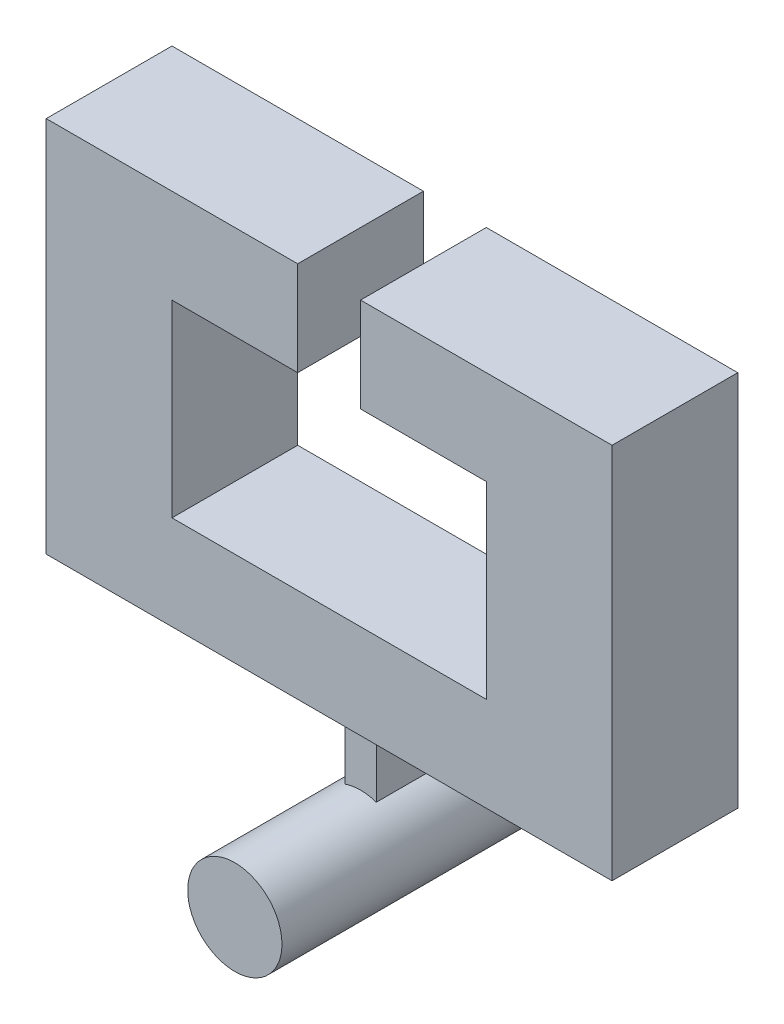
ISO-10303-21;
HEADER;
FILE_DESCRIPTION(('STEP AP214'),'2;1');
FILE_NAME('part.step','',(''),(''),'','','');
FILE_SCHEMA(('AUTOMOTIVE_DESIGN { 1 0 10303 214 1 1 1 1 }'));
ENDSEC;
DATA;
#1=APPLICATION_CONTEXT('core data for automotive mechanical design processes');
#2=APPLICATION_PROTOCOL_DEFINITION('international standard','automotive_design',2000,#1);
#3=PRODUCT_CONTEXT('',#1,'mechanical');
#4=PRODUCT('Part','Part','',(#3));
#5=PRODUCT_RELATED_PRODUCT_CATEGORY('part','',(#4));
#6=PRODUCT_DEFINITION_FORMATION('','',#4);
#7=PRODUCT_DEFINITION_CONTEXT('part definition',#1,'design');
#8=PRODUCT_DEFINITION('design','',#6,#7);
#9=PRODUCT_DEFINITION_SHAPE('','',#8);
#10=(LENGTH_UNIT() NAMED_UNIT(*) SI_UNIT(.MILLI.,.METRE.));
#11=(NAMED_UNIT(*) PLANE_ANGLE_UNIT() SI_UNIT($,.RADIAN.));
#12=(NAMED_UNIT(*) SI_UNIT($,.STERADIAN.) SOLID_ANGLE_UNIT());
#13=UNCERTAINTY_MEASURE_WITH_UNIT(LENGTH_MEASURE(1.E-05),#10,'distance_accuracy_value','');
#14=(GEOMETRIC_REPRESENTATION_CONTEXT(3) GLOBAL_UNCERTAINTY_ASSIGNED_CONTEXT((#13)) GLOBAL_UNIT_ASSIGNED_CONTEXT((#10,
#11,#12)) REPRESENTATION_CONTEXT('',''));
#15=CARTESIAN_POINT('',(0.,0.,0.));
#16=DIRECTION('',(0.,0.,1.));
#17=DIRECTION('',(1.,0.,0.));
#18=AXIS2_PLACEMENT_3D('',#15,#16,#17);
#19=CARTESIAN_POINT('',(57.15,-25.4,44.45));
#20=DIRECTION('',(0.,0.,-1.));
#21=DIRECTION('',(-1.,0.,0.));
#22=AXIS2_PLACEMENT_3D('',#19,#20,#21);
#23=CYLINDRICAL_SURFACE('',#22,9.525);
#24=CARTESIAN_POINT('',(57.15,-25.4,44.45));
#25=DIRECTION('',(0.,0.,1.));
#26=DIRECTION('',(1.,0.,0.));
#27=AXIS2_PLACEMENT_3D('',#24,#25,#26);
#28=CIRCLE('',#27,9.525);
#29=CARTESIAN_POINT('',(66.675,-25.4,44.45));
#30=VERTEX_POINT('',#29);
#31=EDGE_CURVE('E11',#30,#30,#28,.T.);
#32=ORIENTED_EDGE('',*,*,#31,.F.);
#33=EDGE_LOOP('',(#32));
#34=FACE_BOUND('',#33,.T.);
#35=CARTESIAN_POINT('',(57.15,-25.4,-19.05));
#36=DIRECTION('',(0.,0.,1.));
#37=DIRECTION('',(1.,0.,0.));
#38=AXIS2_PLACEMENT_3D('',#35,#36,#37);
#39=CIRCLE('',#38,9.525);
#40=CARTESIAN_POINT('',(66.675,-25.4,-19.05));
#41=VERTEX_POINT('',#40);
#42=EDGE_CURVE('E59',#41,#41,#39,.T.);
#43=ORIENTED_EDGE('',*,*,#42,.T.);
#44=EDGE_LOOP('',(#43));
#45=FACE_BOUND('',#44,.T.);
#46=ADVANCED_FACE('F56',(#34,#45),#23,.T.);
#47=CARTESIAN_POINT('',(57.15,-25.4,44.45));
#48=DIRECTION('',(0.,0.,1.));
#49=DIRECTION('',(1.,0.,0.));
#50=AXIS2_PLACEMENT_3D('',#47,#48,#49);
#51=PLANE('',#50);
#52=ORIENTED_EDGE('',*,*,#31,.T.);
#53=EDGE_LOOP('',(#52));
#54=FACE_BOUND('',#53,.T.);
#55=ADVANCED_FACE('F75',(#54),#51,.T.);
#56=CARTESIAN_POINT('',(57.15,-25.4,-19.05));
#57=DIRECTION('',(0.,0.,1.));
#58=DIRECTION('',(1.,0.,0.));
#59=AXIS2_PLACEMENT_3D('',#56,#57,#58);
#60=PLANE('',#59);
#61=ORIENTED_EDGE('',*,*,#42,.F.);
#62=EDGE_LOOP('',(#61));
#63=FACE_BOUND('',#62,.T.);
#64=ADVANCED_FACE('F73',(#63),#60,.F.);
#65=CLOSED_SHELL('',(#46,#55,#64));
#66=MANIFOLD_SOLID_BREP('B2',#65);
#67=CARTESIAN_POINT('',(53.975,0.,19.05));
#68=DIRECTION('',(0.,1.,0.));
#69=DIRECTION('',(-1.,0.,0.));
#70=AXIS2_PLACEMENT_3D('',#67,#68,#69);
#71=PLANE('',#70);
#72=DIRECTION('',(1.,0.,0.));
#73=VECTOR('',#72,1.);
#74=CARTESIAN_POINT('',(53.975,0.,6.35));
#75=LINE('',#74,#73);
#76=CARTESIAN_POINT('',(53.975,0.,6.35));
#77=VERTEX_POINT('',#76);
#78=CARTESIAN_POINT('',(60.325,0.,6.35));
#79=VERTEX_POINT('',#78);
#80=EDGE_CURVE('E182',#77,#79,#75,.T.);
#81=ORIENTED_EDGE('',*,*,#80,.F.);
#82=DIRECTION('',(0.,0.,-1.));
#83=VECTOR('',#82,1.);
#84=CARTESIAN_POINT('',(53.975,0.,19.05));
#85=LINE('',#84,#83);
#86=CARTESIAN_POINT('',(53.975,0.,19.05));
#87=VERTEX_POINT('',#86);
#88=EDGE_CURVE('E54',#87,#77,#85,.T.);
#89=ORIENTED_EDGE('',*,*,#88,.F.);
#90=DIRECTION('',(1.,0.,0.));
#91=VECTOR('',#90,1.);
#92=CARTESIAN_POINT('',(53.975,0.,19.05));
#93=LINE('',#92,#91);
#94=CARTESIAN_POINT('',(60.325,0.,19.05));
#95=VERTEX_POINT('',#94);
#96=EDGE_CURVE('E173',#87,#95,#93,.T.);
#97=ORIENTED_EDGE('',*,*,#96,.T.);
#98=DIRECTION('',(0.,0.,-1.));
#99=VECTOR('',#98,1.);
#100=CARTESIAN_POINT('',(60.325,0.,19.05));
#101=LINE('',#100,#99);
#102=EDGE_CURVE('E113',#95,#79,#101,.T.);
#103=ORIENTED_EDGE('',*,*,#102,.T.);
#104=EDGE_LOOP('',(#81,#89,#97,#103));
#105=FACE_BOUND('',#104,.T.);
#106=ADVANCED_FACE('F110',(#105),#71,.T.);
#107=CARTESIAN_POINT('',(53.975,0.,19.05));
#108=DIRECTION('',(1.,0.,0.));
#109=DIRECTION('',(0.,0.,-1.));
#110=AXIS2_PLACEMENT_3D('',#107,#108,#109);
#111=PLANE('',#110);
#112=DIRECTION('',(0.,-1.,0.));
#113=VECTOR('',#112,1.);
#114=CARTESIAN_POINT('',(53.975,0.,6.35));
#115=LINE('',#114,#113);
#116=CARTESIAN_POINT('',(53.975,-16.4197438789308,6.35));
#117=VERTEX_POINT('',#116);
#118=EDGE_CURVE('E177',#77,#117,#115,.T.);
#119=ORIENTED_EDGE('',*,*,#118,.T.);
#120=DIRECTION('',(0.,0.,-1.));
#121=VECTOR('',#120,1.);
#122=CARTESIAN_POINT('',(53.975,-16.4197438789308,19.05));
#123=LINE('',#122,#121);
#124=CARTESIAN_POINT('',(53.975,-16.4197438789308,19.05));
#125=VERTEX_POINT('',#124);
#126=EDGE_CURVE('E120',#125,#117,#123,.T.);
#127=ORIENTED_EDGE('',*,*,#126,.F.);
#128=DIRECTION('',(0.,-1.,0.));
#129=VECTOR('',#128,1.);
#130=CARTESIAN_POINT('',(53.975,0.,19.05));
#131=LINE('',#130,#129);
#132=EDGE_CURVE('E168',#87,#125,#131,.T.);
#133=ORIENTED_EDGE('',*,*,#132,.F.);
#134=ORIENTED_EDGE('',*,*,#88,.T.);
#135=EDGE_LOOP('',(#119,#127,#133,#134));
#136=FACE_BOUND('',#135,.T.);
#137=ADVANCED_FACE('F203',(#136),#111,.F.);
#138=CARTESIAN_POINT('',(57.15,-25.4,19.05));
#139=DIRECTION('',(0.,0.,-1.));
#140=DIRECTION('',(-1.,0.,0.));
#141=AXIS2_PLACEMENT_3D('',#138,#139,#140);
#142=CYLINDRICAL_SURFACE('',#141,9.525);
#143=CARTESIAN_POINT('',(57.15,-25.4,6.35));
#144=DIRECTION('',(0.,0.,1.));
#145=DIRECTION('',(1.,0.,0.));
#146=AXIS2_PLACEMENT_3D('',#143,#144,#145);
#147=CIRCLE('',#146,9.525);
#148=CARTESIAN_POINT('',(60.325,-16.4197438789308,6.35));
#149=VERTEX_POINT('',#148);
#150=EDGE_CURVE('E161',#149,#117,#147,.T.);
#151=ORIENTED_EDGE('',*,*,#150,.F.);
#152=DIRECTION('',(0.,0.,-1.));
#153=VECTOR('',#152,1.);
#154=CARTESIAN_POINT('',(60.325,-16.4197438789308,19.05));
#155=LINE('',#154,#153);
#156=CARTESIAN_POINT('',(60.325,-16.4197438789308,19.05));
#157=VERTEX_POINT('',#156);
#158=EDGE_CURVE('E156',#157,#149,#155,.T.);
#159=ORIENTED_EDGE('',*,*,#158,.F.);
#160=CARTESIAN_POINT('',(57.15,-25.4,19.05));
#161=DIRECTION('',(0.,0.,1.));
#162=DIRECTION('',(1.,0.,0.));
#163=AXIS2_PLACEMENT_3D('',#160,#161,#162);
#164=CIRCLE('',#163,9.525);
#165=EDGE_CURVE('E159',#157,#125,#164,.T.);
#166=ORIENTED_EDGE('',*,*,#165,.T.);
#167=ORIENTED_EDGE('',*,*,#126,.T.);
#168=EDGE_LOOP('',(#151,#159,#166,#167));
#169=FACE_BOUND('',#168,.T.);
#170=ADVANCED_FACE('F158',(#169),#142,.F.);
#171=CARTESIAN_POINT('',(60.325,0.,19.05));
#172=DIRECTION('',(1.,0.,0.));
#173=DIRECTION('',(0.,0.,-1.));
#174=AXIS2_PLACEMENT_3D('',#171,#172,#173);
#175=PLANE('',#174);
#176=DIRECTION('',(0.,-1.,0.));
#177=VECTOR('',#176,1.);
#178=CARTESIAN_POINT('',(60.325,0.,6.35));
#179=LINE('',#178,#177);
#180=EDGE_CURVE('E186',#79,#149,#179,.T.);
#181=ORIENTED_EDGE('',*,*,#180,.F.);
#182=ORIENTED_EDGE('',*,*,#102,.F.);
#183=DIRECTION('',(0.,-1.,0.));
#184=VECTOR('',#183,1.);
#185=CARTESIAN_POINT('',(60.325,0.,19.05));
#186=LINE('',#185,#184);
#187=EDGE_CURVE('E167',#95,#157,#186,.T.);
#188=ORIENTED_EDGE('',*,*,#187,.T.);
#189=ORIENTED_EDGE('',*,*,#158,.T.);
#190=EDGE_LOOP('',(#181,#182,#188,#189));
#191=FACE_BOUND('',#190,.T.);
#192=ADVANCED_FACE('F171',(#191),#175,.T.);
#193=CARTESIAN_POINT('',(57.15,-25.4,19.05));
#194=DIRECTION('',(0.,0.,1.));
#195=DIRECTION('',(1.,0.,0.));
#196=AXIS2_PLACEMENT_3D('',#193,#194,#195);
#197=PLANE('',#196);
#198=ORIENTED_EDGE('',*,*,#96,.F.);
#199=ORIENTED_EDGE('',*,*,#132,.T.);
#200=ORIENTED_EDGE('',*,*,#165,.F.);
#201=ORIENTED_EDGE('',*,*,#187,.F.);
#202=EDGE_LOOP('',(#198,#199,#200,#201));
#203=FACE_BOUND('',#202,.T.);
#204=ADVANCED_FACE('F166',(#203),#197,.T.);
#205=CARTESIAN_POINT('',(57.15,-25.4,6.35));
#206=DIRECTION('',(0.,0.,1.));
#207=DIRECTION('',(1.,0.,0.));
#208=AXIS2_PLACEMENT_3D('',#205,#206,#207);
#209=PLANE('',#208);
#210=ORIENTED_EDGE('',*,*,#80,.T.);
#211=ORIENTED_EDGE('',*,*,#180,.T.);
#212=ORIENTED_EDGE('',*,*,#150,.T.);
#213=ORIENTED_EDGE('',*,*,#118,.F.);
#214=EDGE_LOOP('',(#210,#211,#212,#213));
#215=FACE_BOUND('',#214,.T.);
#216=ADVANCED_FACE('F202',(#215),#209,.F.);
#217=CLOSED_SHELL('',(#106,#137,#170,#192,#204,#216));
#218=MANIFOLD_SOLID_BREP('B6',#217);
#219=CARTESIAN_POINT('',(0.,76.2,25.4));
#220=DIRECTION('',(0.,-1.,0.));
#221=DIRECTION('',(0.,0.,-1.));
#222=AXIS2_PLACEMENT_3D('',#219,#220,#221);
#223=PLANE('',#222);
#224=DIRECTION('',(-1.,0.,0.));
#225=VECTOR('',#224,1.);
#226=CARTESIAN_POINT('',(0.,76.2,25.4));
#227=LINE('',#226,#225);
#228=CARTESIAN_POINT('',(50.8,76.2,25.4));
#229=VERTEX_POINT('',#228);
#230=CARTESIAN_POINT('',(0.,76.2,25.4));
#231=VERTEX_POINT('',#230);
#232=EDGE_CURVE('E283',#229,#231,#227,.T.);
#233=ORIENTED_EDGE('',*,*,#232,.F.);
#234=DIRECTION('',(0.,0.,1.));
#235=VECTOR('',#234,1.);
#236=CARTESIAN_POINT('',(50.8,76.2,-0.001000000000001));
#237=LINE('',#236,#235);
#238=CARTESIAN_POINT('',(50.8,76.2,0.));
#239=VERTEX_POINT('',#238);
#240=EDGE_CURVE('E369',#239,#229,#237,.T.);
#241=ORIENTED_EDGE('',*,*,#240,.F.);
#242=DIRECTION('',(-1.,0.,0.));
#243=VECTOR('',#242,1.);
#244=CARTESIAN_POINT('',(0.,76.2,0.));
#245=LINE('',#244,#243);
#246=CARTESIAN_POINT('',(0.,76.2,0.));
#247=VERTEX_POINT('',#246);
#248=EDGE_CURVE('E305',#239,#247,#245,.T.);
#249=ORIENTED_EDGE('',*,*,#248,.T.);
#250=DIRECTION('',(0.,0.,-1.));
#251=VECTOR('',#250,1.);
#252=CARTESIAN_POINT('',(0.,76.2,25.4));
#253=LINE('',#252,#251);
#254=EDGE_CURVE('E400',#231,#247,#253,.T.);
#255=ORIENTED_EDGE('',*,*,#254,.F.);
#256=EDGE_LOOP('',(#233,#241,#249,#255));
#257=FACE_BOUND('',#256,.T.);
#258=ADVANCED_FACE('F258',(#257),#223,.F.);
#259=CARTESIAN_POINT('',(0.,0.,25.4));
#260=DIRECTION('',(1.,0.,0.));
#261=DIRECTION('',(0.,0.,-1.));
#262=AXIS2_PLACEMENT_3D('',#259,#260,#261);
#263=PLANE('',#262);
#264=DIRECTION('',(0.,-1.,0.));
#265=VECTOR('',#264,1.);
#266=CARTESIAN_POINT('',(0.,0.,0.));
#267=LINE('',#266,#265);
#268=CARTESIAN_POINT('',(0.,0.,0.));
#269=VERTEX_POINT('',#268);
#270=EDGE_CURVE('E419',#247,#269,#267,.T.);
#271=ORIENTED_EDGE('',*,*,#270,.T.);
#272=DIRECTION('',(0.,0.,-1.));
#273=VECTOR('',#272,1.);
#274=CARTESIAN_POINT('',(0.,0.,25.4));
#275=LINE('',#274,#273);
#276=CARTESIAN_POINT('',(0.,0.,25.4));
#277=VERTEX_POINT('',#276);
#278=EDGE_CURVE('E108',#277,#269,#275,.T.);
#279=ORIENTED_EDGE('',*,*,#278,.F.);
#280=DIRECTION('',(0.,-1.,0.));
#281=VECTOR('',#280,1.);
#282=CARTESIAN_POINT('',(0.,0.,25.4));
#283=LINE('',#282,#281);
#284=EDGE_CURVE('E389',#231,#277,#283,.T.);
#285=ORIENTED_EDGE('',*,*,#284,.F.);
#286=ORIENTED_EDGE('',*,*,#254,.T.);
#287=EDGE_LOOP('',(#271,#279,#285,#286));
#288=FACE_BOUND('',#287,.T.);
#289=ADVANCED_FACE('F260',(#288),#263,.F.);
#290=CARTESIAN_POINT('',(0.,0.,25.4));
#291=DIRECTION('',(0.,1.,0.));
#292=DIRECTION('',(0.,0.,1.));
#293=AXIS2_PLACEMENT_3D('',#290,#291,#292);
#294=PLANE('',#293);
#295=DIRECTION('',(1.,0.,0.));
#296=VECTOR('',#295,1.);
#297=CARTESIAN_POINT('',(0.,0.,0.));
#298=LINE('',#297,#296);
#299=CARTESIAN_POINT('',(114.3,0.,0.));
#300=VERTEX_POINT('',#299);
#301=EDGE_CURVE('E414',#269,#300,#298,.T.);
#302=ORIENTED_EDGE('',*,*,#301,.T.);
#303=DIRECTION('',(0.,0.,-1.));
#304=VECTOR('',#303,1.);
#305=CARTESIAN_POINT('',(114.3,0.,25.4));
#306=LINE('',#305,#304);
#307=CARTESIAN_POINT('',(114.3,0.,25.4));
#308=VERTEX_POINT('',#307);
#309=EDGE_CURVE('E267',#308,#300,#306,.T.);
#310=ORIENTED_EDGE('',*,*,#309,.F.);
#311=DIRECTION('',(1.,0.,0.));
#312=VECTOR('',#311,1.);
#313=CARTESIAN_POINT('',(0.,0.,25.4));
#314=LINE('',#313,#312);
#315=EDGE_CURVE('E312',#277,#308,#314,.T.);
#316=ORIENTED_EDGE('',*,*,#315,.F.);
#317=ORIENTED_EDGE('',*,*,#278,.T.);
#318=EDGE_LOOP('',(#302,#310,#316,#317));
#319=FACE_BOUND('',#318,.T.);
#320=ADVANCED_FACE('F515',(#319),#294,.F.);
#321=CARTESIAN_POINT('',(114.3,0.,25.4));
#322=DIRECTION('',(-1.,0.,0.));
#323=DIRECTION('',(0.,0.,1.));
#324=AXIS2_PLACEMENT_3D('',#321,#322,#323);
#325=PLANE('',#324);
#326=DIRECTION('',(0.,1.,0.));
#327=VECTOR('',#326,1.);
#328=CARTESIAN_POINT('',(114.3,0.,0.));
#329=LINE('',#328,#327);
#330=CARTESIAN_POINT('',(114.3,76.2,0.));
#331=VERTEX_POINT('',#330);
#332=EDGE_CURVE('E396',#300,#331,#329,.T.);
#333=ORIENTED_EDGE('',*,*,#332,.T.);
#334=DIRECTION('',(0.,0.,-1.));
#335=VECTOR('',#334,1.);
#336=CARTESIAN_POINT('',(114.3,76.2,25.4));
#337=LINE('',#336,#335);
#338=CARTESIAN_POINT('',(114.3,76.2,25.4));
#339=VERTEX_POINT('',#338);
#340=EDGE_CURVE('E387',#339,#331,#337,.T.);
#341=ORIENTED_EDGE('',*,*,#340,.F.);
#342=DIRECTION('',(0.,1.,0.));
#343=VECTOR('',#342,1.);
#344=CARTESIAN_POINT('',(114.3,0.,25.4));
#345=LINE('',#344,#343);
#346=EDGE_CURVE('E412',#308,#339,#345,.T.);
#347=ORIENTED_EDGE('',*,*,#346,.F.);
#348=ORIENTED_EDGE('',*,*,#309,.T.);
#349=EDGE_LOOP('',(#333,#341,#347,#348));
#350=FACE_BOUND('',#349,.T.);
#351=ADVANCED_FACE('F411',(#350),#325,.F.);
#352=CARTESIAN_POINT('',(63.5,76.2,0.));
#353=VERTEX_POINT('',#352);
#354=EDGE_CURVE('E378',#331,#353,#245,.T.);
#355=ORIENTED_EDGE('',*,*,#354,.T.);
#356=DIRECTION('',(0.,0.,1.));
#357=VECTOR('',#356,1.);
#358=CARTESIAN_POINT('',(63.5,76.2,-0.001000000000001));
#359=LINE('',#358,#357);
#360=CARTESIAN_POINT('',(63.5,76.2,25.4));
#361=VERTEX_POINT('',#360);
#362=EDGE_CURVE('E357',#353,#361,#359,.T.);
#363=ORIENTED_EDGE('',*,*,#362,.T.);
#364=EDGE_CURVE('E403',#339,#361,#227,.T.);
#365=ORIENTED_EDGE('',*,*,#364,.F.);
#366=ORIENTED_EDGE('',*,*,#340,.T.);
#367=EDGE_LOOP('',(#355,#363,#365,#366));
#368=FACE_BOUND('',#367,.T.);
#369=ADVANCED_FACE('F385',(#368),#223,.F.);
#370=CARTESIAN_POINT('',(0.,0.,25.4));
#371=DIRECTION('',(0.,0.,-1.));
#372=DIRECTION('',(-1.,0.,0.));
#373=AXIS2_PLACEMENT_3D('',#370,#371,#372);
#374=PLANE('',#373);
#375=DIRECTION('',(-1.,0.,0.));
#376=VECTOR('',#375,1.);
#377=CARTESIAN_POINT('',(50.8,57.15,25.4));
#378=LINE('',#377,#376);
#379=CARTESIAN_POINT('',(50.8,57.15,25.4));
#380=VERTEX_POINT('',#379);
#381=CARTESIAN_POINT('',(25.4,57.15,25.4));
#382=VERTEX_POINT('',#381);
#383=EDGE_CURVE('E472',#380,#382,#378,.T.);
#384=ORIENTED_EDGE('',*,*,#383,.F.);
#385=DIRECTION('',(0.,-1.,0.));
#386=VECTOR('',#385,1.);
#387=CARTESIAN_POINT('',(50.8,76.2,25.4));
#388=LINE('',#387,#386);
#389=EDGE_CURVE('E475',#229,#380,#388,.T.);
#390=ORIENTED_EDGE('',*,*,#389,.F.);
#391=ORIENTED_EDGE('',*,*,#232,.T.);
#392=ORIENTED_EDGE('',*,*,#284,.T.);
#393=ORIENTED_EDGE('',*,*,#315,.T.);
#394=ORIENTED_EDGE('',*,*,#346,.T.);
#395=ORIENTED_EDGE('',*,*,#364,.T.);
#396=DIRECTION('',(0.,1.,0.));
#397=VECTOR('',#396,1.);
#398=CARTESIAN_POINT('',(63.5,57.15,25.4));
#399=LINE('',#398,#397);
#400=CARTESIAN_POINT('',(63.5,57.15,25.4));
#401=VERTEX_POINT('',#400);
#402=EDGE_CURVE('E363',#401,#361,#399,.T.);
#403=ORIENTED_EDGE('',*,*,#402,.F.);
#404=DIRECTION('',(-1.,0.,0.));
#405=VECTOR('',#404,1.);
#406=CARTESIAN_POINT('',(88.9,57.15,25.4));
#407=LINE('',#406,#405);
#408=CARTESIAN_POINT('',(88.9,57.15,25.4));
#409=VERTEX_POINT('',#408);
#410=EDGE_CURVE('E456',#409,#401,#407,.T.);
#411=ORIENTED_EDGE('',*,*,#410,.F.);
#412=DIRECTION('',(0.,1.,0.));
#413=VECTOR('',#412,1.);
#414=CARTESIAN_POINT('',(88.9,19.05,25.4));
#415=LINE('',#414,#413);
#416=CARTESIAN_POINT('',(88.9,19.05,25.4));
#417=VERTEX_POINT('',#416);
#418=EDGE_CURVE('E460',#417,#409,#415,.T.);
#419=ORIENTED_EDGE('',*,*,#418,.F.);
#420=DIRECTION('',(1.,0.,0.));
#421=VECTOR('',#420,1.);
#422=CARTESIAN_POINT('',(25.4,19.05,25.4));
#423=LINE('',#422,#421);
#424=CARTESIAN_POINT('',(25.4,19.05,25.4));
#425=VERTEX_POINT('',#424);
#426=EDGE_CURVE('E464',#425,#417,#423,.T.);
#427=ORIENTED_EDGE('',*,*,#426,.F.);
#428=DIRECTION('',(0.,-1.,0.));
#429=VECTOR('',#428,1.);
#430=CARTESIAN_POINT('',(25.4,57.15,25.4));
#431=LINE('',#430,#429);
#432=EDGE_CURVE('E468',#382,#425,#431,.T.);
#433=ORIENTED_EDGE('',*,*,#432,.F.);
#434=EDGE_LOOP('',(#384,#390,#391,#392,#393,#394,#395,#403,#411,#419,#427,#433));
#435=FACE_BOUND('',#434,.T.);
#436=ADVANCED_FACE('F511',(#435),#374,.F.);
#437=CARTESIAN_POINT('',(0.,0.,0.));
#438=DIRECTION('',(0.,0.,-1.));
#439=DIRECTION('',(-1.,0.,0.));
#440=AXIS2_PLACEMENT_3D('',#437,#438,#439);
#441=PLANE('',#440);
#442=DIRECTION('',(0.,-1.,0.));
#443=VECTOR('',#442,1.);
#444=CARTESIAN_POINT('',(50.8,76.2,0.));
#445=LINE('',#444,#443);
#446=CARTESIAN_POINT('',(50.8,57.15,0.));
#447=VERTEX_POINT('',#446);
#448=EDGE_CURVE('E382',#239,#447,#445,.T.);
#449=ORIENTED_EDGE('',*,*,#448,.T.);
#450=DIRECTION('',(-1.,0.,0.));
#451=VECTOR('',#450,1.);
#452=CARTESIAN_POINT('',(50.8,57.15,0.));
#453=LINE('',#452,#451);
#454=CARTESIAN_POINT('',(25.4,57.15,0.));
#455=VERTEX_POINT('',#454);
#456=EDGE_CURVE('E424',#447,#455,#453,.T.);
#457=ORIENTED_EDGE('',*,*,#456,.T.);
#458=DIRECTION('',(0.,-1.,0.));
#459=VECTOR('',#458,1.);
#460=CARTESIAN_POINT('',(25.4,57.15,0.));
#461=LINE('',#460,#459);
#462=CARTESIAN_POINT('',(25.4,19.05,0.));
#463=VERTEX_POINT('',#462);
#464=EDGE_CURVE('E490',#455,#463,#461,.T.);
#465=ORIENTED_EDGE('',*,*,#464,.T.);
#466=DIRECTION('',(1.,0.,0.));
#467=VECTOR('',#466,1.);
#468=CARTESIAN_POINT('',(25.4,19.05,0.));
#469=LINE('',#468,#467);
#470=CARTESIAN_POINT('',(88.9,19.05,0.));
#471=VERTEX_POINT('',#470);
#472=EDGE_CURVE('E486',#463,#471,#469,.T.);
#473=ORIENTED_EDGE('',*,*,#472,.T.);
#474=DIRECTION('',(0.,1.,0.));
#475=VECTOR('',#474,1.);
#476=CARTESIAN_POINT('',(88.9,19.05,0.));
#477=LINE('',#476,#475);
#478=CARTESIAN_POINT('',(88.9,57.15,0.));
#479=VERTEX_POINT('',#478);
#480=EDGE_CURVE('E483',#471,#479,#477,.T.);
#481=ORIENTED_EDGE('',*,*,#480,.T.);
#482=DIRECTION('',(-1.,0.,0.));
#483=VECTOR('',#482,1.);
#484=CARTESIAN_POINT('',(88.9,57.15,0.));
#485=LINE('',#484,#483);
#486=CARTESIAN_POINT('',(63.5,57.15,0.));
#487=VERTEX_POINT('',#486);
#488=EDGE_CURVE('E380',#479,#487,#485,.T.);
#489=ORIENTED_EDGE('',*,*,#488,.T.);
#490=DIRECTION('',(0.,1.,0.));
#491=VECTOR('',#490,1.);
#492=CARTESIAN_POINT('',(63.5,57.15,0.));
#493=LINE('',#492,#491);
#494=EDGE_CURVE('E360',#487,#353,#493,.T.);
#495=ORIENTED_EDGE('',*,*,#494,.T.);
#496=ORIENTED_EDGE('',*,*,#354,.F.);
#497=ORIENTED_EDGE('',*,*,#332,.F.);
#498=ORIENTED_EDGE('',*,*,#301,.F.);
#499=ORIENTED_EDGE('',*,*,#270,.F.);
#500=ORIENTED_EDGE('',*,*,#248,.F.);
#501=EDGE_LOOP('',(#449,#457,#465,#473,#481,#489,#495,#496,#497,#498,#499,#500));
#502=FACE_BOUND('',#501,.T.);
#503=ADVANCED_FACE('F376',(#502),#441,.T.);
#504=CARTESIAN_POINT('',(50.8,76.2,-0.001000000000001));
#505=DIRECTION('',(-1.,0.,0.));
#506=DIRECTION('',(0.,0.,1.));
#507=AXIS2_PLACEMENT_3D('',#504,#505,#506);
#508=PLANE('',#507);
#509=ORIENTED_EDGE('',*,*,#240,.T.);
#510=ORIENTED_EDGE('',*,*,#389,.T.);
#511=DIRECTION('',(0.,0.,1.));
#512=VECTOR('',#511,1.);
#513=CARTESIAN_POINT('',(50.8,57.15,-0.001000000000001));
#514=LINE('',#513,#512);
#515=EDGE_CURVE('E436',#447,#380,#514,.T.);
#516=ORIENTED_EDGE('',*,*,#515,.F.);
#517=ORIENTED_EDGE('',*,*,#448,.F.);
#518=EDGE_LOOP('',(#509,#510,#516,#517));
#519=FACE_BOUND('',#518,.T.);
#520=ADVANCED_FACE('F535',(#519),#508,.F.);
#521=CARTESIAN_POINT('',(63.5,57.15,-0.001000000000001));
#522=DIRECTION('',(1.,0.,0.));
#523=DIRECTION('',(0.,0.,-1.));
#524=AXIS2_PLACEMENT_3D('',#521,#522,#523);
#525=PLANE('',#524);
#526=DIRECTION('',(0.,0.,1.));
#527=VECTOR('',#526,1.);
#528=CARTESIAN_POINT('',(63.5,57.15,-0.001000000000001));
#529=LINE('',#528,#527);
#530=EDGE_CURVE('E370',#487,#401,#529,.T.);
#531=ORIENTED_EDGE('',*,*,#530,.T.);
#532=ORIENTED_EDGE('',*,*,#402,.T.);
#533=ORIENTED_EDGE('',*,*,#362,.F.);
#534=ORIENTED_EDGE('',*,*,#494,.F.);
#535=EDGE_LOOP('',(#531,#532,#533,#534));
#536=FACE_BOUND('',#535,.T.);
#537=ADVANCED_FACE('F359',(#536),#525,.F.);
#538=CARTESIAN_POINT('',(88.9,57.15,-0.001000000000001));
#539=DIRECTION('',(0.,1.,0.));
#540=DIRECTION('',(-1.,0.,0.));
#541=AXIS2_PLACEMENT_3D('',#538,#539,#540);
#542=PLANE('',#541);
#543=DIRECTION('',(0.,0.,1.));
#544=VECTOR('',#543,1.);
#545=CARTESIAN_POINT('',(88.9,57.15,-0.001000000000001));
#546=LINE('',#545,#544);
#547=EDGE_CURVE('E447',#479,#409,#546,.T.);
#548=ORIENTED_EDGE('',*,*,#547,.T.);
#549=ORIENTED_EDGE('',*,*,#410,.T.);
#550=ORIENTED_EDGE('',*,*,#530,.F.);
#551=ORIENTED_EDGE('',*,*,#488,.F.);
#552=EDGE_LOOP('',(#548,#549,#550,#551));
#553=FACE_BOUND('',#552,.T.);
#554=ADVANCED_FACE('F509',(#553),#542,.F.);
#555=CARTESIAN_POINT('',(88.9,19.05,-0.001000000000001));
#556=DIRECTION('',(1.,0.,0.));
#557=DIRECTION('',(0.,1.,0.));
#558=AXIS2_PLACEMENT_3D('',#555,#556,#557);
#559=PLANE('',#558);
#560=DIRECTION('',(0.,0.,1.));
#561=VECTOR('',#560,1.);
#562=CARTESIAN_POINT('',(88.9,19.05,-0.001000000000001));
#563=LINE('',#562,#561);
#564=EDGE_CURVE('E444',#471,#417,#563,.T.);
#565=ORIENTED_EDGE('',*,*,#564,.T.);
#566=ORIENTED_EDGE('',*,*,#418,.T.);
#567=ORIENTED_EDGE('',*,*,#547,.F.);
#568=ORIENTED_EDGE('',*,*,#480,.F.);
#569=EDGE_LOOP('',(#565,#566,#567,#568));
#570=FACE_BOUND('',#569,.T.);
#571=ADVANCED_FACE('F505',(#570),#559,.F.);
#572=CARTESIAN_POINT('',(25.4,19.05,-0.001000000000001));
#573=DIRECTION('',(0.,-1.,0.));
#574=DIRECTION('',(1.,0.,0.));
#575=AXIS2_PLACEMENT_3D('',#572,#573,#574);
#576=PLANE('',#575);
#577=DIRECTION('',(0.,0.,1.));
#578=VECTOR('',#577,1.);
#579=CARTESIAN_POINT('',(25.4,19.05,-0.001000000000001));
#580=LINE('',#579,#578);
#581=EDGE_CURVE('E441',#463,#425,#580,.T.);
#582=ORIENTED_EDGE('',*,*,#581,.T.);
#583=ORIENTED_EDGE('',*,*,#426,.T.);
#584=ORIENTED_EDGE('',*,*,#564,.F.);
#585=ORIENTED_EDGE('',*,*,#472,.F.);
#586=EDGE_LOOP('',(#582,#583,#584,#585));
#587=FACE_BOUND('',#586,.T.);
#588=ADVANCED_FACE('F501',(#587),#576,.F.);
#589=CARTESIAN_POINT('',(25.4,57.15,-0.001000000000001));
#590=DIRECTION('',(-1.,0.,0.));
#591=DIRECTION('',(0.,-1.,0.));
#592=AXIS2_PLACEMENT_3D('',#589,#590,#591);
#593=PLANE('',#592);
#594=DIRECTION('',(0.,0.,1.));
#595=VECTOR('',#594,1.);
#596=CARTESIAN_POINT('',(25.4,57.15,-0.001000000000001));
#597=LINE('',#596,#595);
#598=EDGE_CURVE('E274',#455,#382,#597,.T.);
#599=ORIENTED_EDGE('',*,*,#598,.T.);
#600=ORIENTED_EDGE('',*,*,#432,.T.);
#601=ORIENTED_EDGE('',*,*,#581,.F.);
#602=ORIENTED_EDGE('',*,*,#464,.F.);
#603=EDGE_LOOP('',(#599,#600,#601,#602));
#604=FACE_BOUND('',#603,.T.);
#605=ADVANCED_FACE('F497',(#604),#593,.F.);
#606=CARTESIAN_POINT('',(50.8,57.15,-0.001000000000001));
#607=DIRECTION('',(0.,1.,0.));
#608=DIRECTION('',(0.,0.,1.));
#609=AXIS2_PLACEMENT_3D('',#606,#607,#608);
#610=PLANE('',#609);
#611=ORIENTED_EDGE('',*,*,#515,.T.);
#612=ORIENTED_EDGE('',*,*,#383,.T.);
#613=ORIENTED_EDGE('',*,*,#598,.F.);
#614=ORIENTED_EDGE('',*,*,#456,.F.);
#615=EDGE_LOOP('',(#611,#612,#613,#614));
#616=FACE_BOUND('',#615,.T.);
#617=ADVANCED_FACE('F540',(#616),#610,.F.);
#618=CLOSED_SHELL('',(#258,#289,#320,#351,#369,#436,#503,#520,#537,#554,#571,#588,#605,#617));
#619=MANIFOLD_SOLID_BREP('B48',#618);
#620=ADVANCED_BREP_SHAPE_REPRESENTATION('',(#18,#66,#218,#619),#14);
#621=SHAPE_DEFINITION_REPRESENTATION(#9,#620);
ENDSEC;
END-ISO-10303-21;
